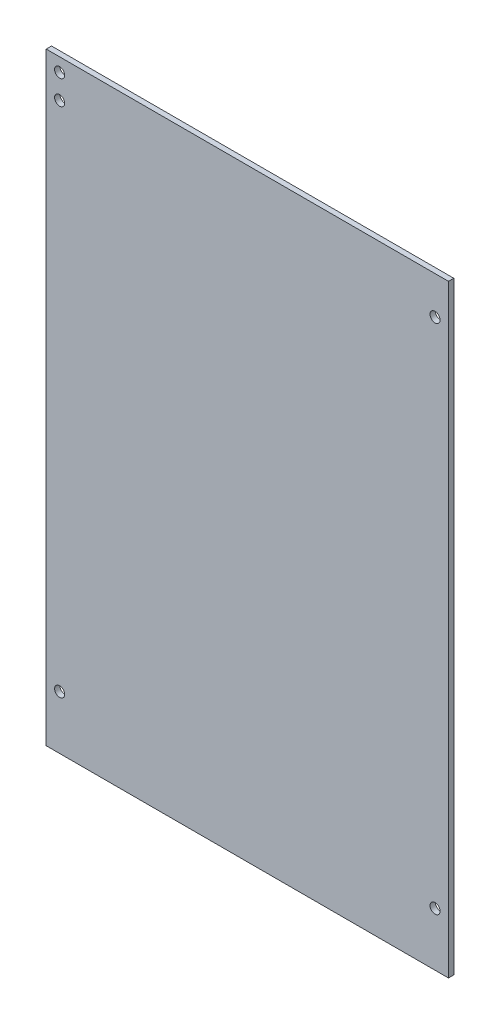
ISO-10303-21;
HEADER;
FILE_DESCRIPTION(('STEP AP214'),'2;1');
FILE_NAME('part.step','',(''),(''),'','','');
FILE_SCHEMA(('AUTOMOTIVE_DESIGN { 1 0 10303 214 1 1 1 1 }'));
ENDSEC;
DATA;
#1=APPLICATION_CONTEXT('core data for automotive mechanical design processes');
#2=APPLICATION_PROTOCOL_DEFINITION('international standard','automotive_design',2000,#1);
#3=PRODUCT_CONTEXT('',#1,'mechanical');
#4=PRODUCT('Part','Part','',(#3));
#5=PRODUCT_RELATED_PRODUCT_CATEGORY('part','',(#4));
#6=PRODUCT_DEFINITION_FORMATION('','',#4);
#7=PRODUCT_DEFINITION_CONTEXT('part definition',#1,'design');
#8=PRODUCT_DEFINITION('design','',#6,#7);
#9=PRODUCT_DEFINITION_SHAPE('','',#8);
#10=(LENGTH_UNIT() NAMED_UNIT(*) SI_UNIT(.MILLI.,.METRE.));
#11=(NAMED_UNIT(*) PLANE_ANGLE_UNIT() SI_UNIT($,.RADIAN.));
#12=(NAMED_UNIT(*) SI_UNIT($,.STERADIAN.) SOLID_ANGLE_UNIT());
#13=UNCERTAINTY_MEASURE_WITH_UNIT(LENGTH_MEASURE(1.E-05),#10,'distance_accuracy_value','');
#14=(GEOMETRIC_REPRESENTATION_CONTEXT(3) GLOBAL_UNCERTAINTY_ASSIGNED_CONTEXT((#13)) GLOBAL_UNIT_ASSIGNED_CONTEXT((#10,
#11,#12)) REPRESENTATION_CONTEXT('',''));
#15=CARTESIAN_POINT('',(0.,0.,0.));
#16=DIRECTION('',(0.,0.,1.));
#17=DIRECTION('',(1.,0.,0.));
#18=AXIS2_PLACEMENT_3D('',#15,#16,#17);
#19=CARTESIAN_POINT('',(-60.,90.,0.79375));
#20=DIRECTION('',(-1.,0.,0.));
#21=DIRECTION('',(0.,-1.,0.));
#22=AXIS2_PLACEMENT_3D('',#19,#20,#21);
#23=PLANE('',#22);
#24=DIRECTION('',(0.,1.,0.));
#25=VECTOR('',#24,1.);
#26=CARTESIAN_POINT('',(-60.,90.,-0.79375));
#27=LINE('',#26,#25);
#28=CARTESIAN_POINT('',(-60.,-90.,-0.79375));
#29=VERTEX_POINT('',#28);
#30=CARTESIAN_POINT('',(-60.,90.,-0.79375));
#31=VERTEX_POINT('',#30);
#32=EDGE_CURVE('E96',#29,#31,#27,.T.);
#33=ORIENTED_EDGE('',*,*,#32,.F.);
#34=DIRECTION('',(0.,0.,-1.));
#35=VECTOR('',#34,1.);
#36=CARTESIAN_POINT('',(-60.,-90.,0.79375));
#37=LINE('',#36,#35);
#38=CARTESIAN_POINT('',(-60.,-90.,0.79375));
#39=VERTEX_POINT('',#38);
#40=EDGE_CURVE('E11',#39,#29,#37,.T.);
#41=ORIENTED_EDGE('',*,*,#40,.F.);
#42=DIRECTION('',(0.,1.,0.));
#43=VECTOR('',#42,1.);
#44=CARTESIAN_POINT('',(-60.,90.,0.79375));
#45=LINE('',#44,#43);
#46=CARTESIAN_POINT('',(-60.,90.,0.79375));
#47=VERTEX_POINT('',#46);
#48=EDGE_CURVE('E89',#39,#47,#45,.T.);
#49=ORIENTED_EDGE('',*,*,#48,.T.);
#50=DIRECTION('',(0.,0.,-1.));
#51=VECTOR('',#50,1.);
#52=CARTESIAN_POINT('',(-60.,90.,0.79375));
#53=LINE('',#52,#51);
#54=EDGE_CURVE('E34',#47,#31,#53,.T.);
#55=ORIENTED_EDGE('',*,*,#54,.T.);
#56=EDGE_LOOP('',(#33,#41,#49,#55));
#57=FACE_BOUND('',#56,.T.);
#58=ADVANCED_FACE('F31',(#57),#23,.T.);
#59=CARTESIAN_POINT('',(-60.,-90.,0.79375));
#60=DIRECTION('',(0.,-1.,0.));
#61=DIRECTION('',(1.,0.,0.));
#62=AXIS2_PLACEMENT_3D('',#59,#60,#61);
#63=PLANE('',#62);
#64=DIRECTION('',(-1.,0.,0.));
#65=VECTOR('',#64,1.);
#66=CARTESIAN_POINT('',(-60.,-90.,-0.79375));
#67=LINE('',#66,#65);
#68=CARTESIAN_POINT('',(60.,-90.,-0.79375));
#69=VERTEX_POINT('',#68);
#70=EDGE_CURVE('E91',#69,#29,#67,.T.);
#71=ORIENTED_EDGE('',*,*,#70,.F.);
#72=DIRECTION('',(0.,0.,-1.));
#73=VECTOR('',#72,1.);
#74=CARTESIAN_POINT('',(60.,-90.,0.79375));
#75=LINE('',#74,#73);
#76=CARTESIAN_POINT('',(60.,-90.,0.79375));
#77=VERTEX_POINT('',#76);
#78=EDGE_CURVE('E40',#77,#69,#75,.T.);
#79=ORIENTED_EDGE('',*,*,#78,.F.);
#80=DIRECTION('',(-1.,0.,0.));
#81=VECTOR('',#80,1.);
#82=CARTESIAN_POINT('',(-60.,-90.,0.79375));
#83=LINE('',#82,#81);
#84=EDGE_CURVE('E86',#77,#39,#83,.T.);
#85=ORIENTED_EDGE('',*,*,#84,.T.);
#86=ORIENTED_EDGE('',*,*,#40,.T.);
#87=EDGE_LOOP('',(#71,#79,#85,#86));
#88=FACE_BOUND('',#87,.T.);
#89=ADVANCED_FACE('F107',(#88),#63,.T.);
#90=CARTESIAN_POINT('',(60.,90.,0.79375));
#91=DIRECTION('',(1.,0.,0.));
#92=DIRECTION('',(0.,1.,0.));
#93=AXIS2_PLACEMENT_3D('',#90,#91,#92);
#94=PLANE('',#93);
#95=DIRECTION('',(0.,-1.,0.));
#96=VECTOR('',#95,1.);
#97=CARTESIAN_POINT('',(60.,90.,-0.79375));
#98=LINE('',#97,#96);
#99=CARTESIAN_POINT('',(60.,90.,-0.79375));
#100=VERTEX_POINT('',#99);
#101=EDGE_CURVE('E81',#100,#69,#98,.T.);
#102=ORIENTED_EDGE('',*,*,#101,.F.);
#103=DIRECTION('',(0.,0.,-1.));
#104=VECTOR('',#103,1.);
#105=CARTESIAN_POINT('',(60.,90.,0.79375));
#106=LINE('',#105,#104);
#107=CARTESIAN_POINT('',(60.,90.,0.79375));
#108=VERTEX_POINT('',#107);
#109=EDGE_CURVE('E76',#108,#100,#106,.T.);
#110=ORIENTED_EDGE('',*,*,#109,.F.);
#111=DIRECTION('',(0.,-1.,0.));
#112=VECTOR('',#111,1.);
#113=CARTESIAN_POINT('',(60.,90.,0.79375));
#114=LINE('',#113,#112);
#115=EDGE_CURVE('E79',#108,#77,#114,.T.);
#116=ORIENTED_EDGE('',*,*,#115,.T.);
#117=ORIENTED_EDGE('',*,*,#78,.T.);
#118=EDGE_LOOP('',(#102,#110,#116,#117));
#119=FACE_BOUND('',#118,.T.);
#120=ADVANCED_FACE('F78',(#119),#94,.T.);
#121=CARTESIAN_POINT('',(-60.,90.,0.79375));
#122=DIRECTION('',(0.,1.,0.));
#123=DIRECTION('',(-1.,0.,0.));
#124=AXIS2_PLACEMENT_3D('',#121,#122,#123);
#125=PLANE('',#124);
#126=DIRECTION('',(1.,0.,0.));
#127=VECTOR('',#126,1.);
#128=CARTESIAN_POINT('',(-60.,90.,-0.79375));
#129=LINE('',#128,#127);
#130=EDGE_CURVE('E99',#31,#100,#129,.T.);
#131=ORIENTED_EDGE('',*,*,#130,.F.);
#132=ORIENTED_EDGE('',*,*,#54,.F.);
#133=DIRECTION('',(1.,0.,0.));
#134=VECTOR('',#133,1.);
#135=CARTESIAN_POINT('',(-60.,90.,0.79375));
#136=LINE('',#135,#134);
#137=EDGE_CURVE('E85',#47,#108,#136,.T.);
#138=ORIENTED_EDGE('',*,*,#137,.T.);
#139=ORIENTED_EDGE('',*,*,#109,.T.);
#140=EDGE_LOOP('',(#131,#132,#138,#139));
#141=FACE_BOUND('',#140,.T.);
#142=ADVANCED_FACE('F88',(#141),#125,.T.);
#143=CARTESIAN_POINT('',(-60.,-90.,0.79375));
#144=DIRECTION('',(0.,0.,1.));
#145=DIRECTION('',(1.,0.,0.));
#146=AXIS2_PLACEMENT_3D('',#143,#144,#145);
#147=PLANE('',#146);
#148=CARTESIAN_POINT('',(-56.,85.98,0.79375));
#149=DIRECTION('',(0.,0.,1.));
#150=DIRECTION('',(1.,0.,0.));
#151=AXIS2_PLACEMENT_3D('',#148,#149,#150);
#152=CIRCLE('',#151,1.5);
#153=CARTESIAN_POINT('',(-54.5,85.98,0.79375));
#154=VERTEX_POINT('',#153);
#155=EDGE_CURVE('E155',#154,#154,#152,.T.);
#156=ORIENTED_EDGE('',*,*,#155,.F.);
#157=EDGE_LOOP('',(#156));
#158=FACE_BOUND('',#157,.T.);
#159=CARTESIAN_POINT('',(-56.,78.74,0.79375));
#160=DIRECTION('',(0.,0.,1.));
#161=DIRECTION('',(-1.,0.,0.));
#162=AXIS2_PLACEMENT_3D('',#159,#160,#161);
#163=CIRCLE('',#162,1.5);
#164=CARTESIAN_POINT('',(-57.5,78.74,0.79375));
#165=VERTEX_POINT('',#164);
#166=EDGE_CURVE('E157',#165,#165,#163,.T.);
#167=ORIENTED_EDGE('',*,*,#166,.F.);
#168=EDGE_LOOP('',(#167));
#169=FACE_BOUND('',#168,.T.);
#170=CARTESIAN_POINT('',(56.,78.74,0.79375));
#171=DIRECTION('',(0.,0.,1.));
#172=DIRECTION('',(1.,0.,0.));
#173=AXIS2_PLACEMENT_3D('',#170,#171,#172);
#174=CIRCLE('',#173,1.5);
#175=CARTESIAN_POINT('',(57.5,78.74,0.79375));
#176=VERTEX_POINT('',#175);
#177=EDGE_CURVE('E163',#176,#176,#174,.T.);
#178=ORIENTED_EDGE('',*,*,#177,.F.);
#179=EDGE_LOOP('',(#178));
#180=FACE_BOUND('',#179,.T.);
#181=CARTESIAN_POINT('',(56.,-74.,0.79375));
#182=DIRECTION('',(0.,0.,1.));
#183=DIRECTION('',(-1.,0.,0.));
#184=AXIS2_PLACEMENT_3D('',#181,#182,#183);
#185=CIRCLE('',#184,1.5);
#186=CARTESIAN_POINT('',(54.5,-74.,0.79375));
#187=VERTEX_POINT('',#186);
#188=EDGE_CURVE('E169',#187,#187,#185,.T.);
#189=ORIENTED_EDGE('',*,*,#188,.F.);
#190=EDGE_LOOP('',(#189));
#191=FACE_BOUND('',#190,.T.);
#192=CARTESIAN_POINT('',(-56.,-74.,0.79375));
#193=DIRECTION('',(0.,0.,1.));
#194=DIRECTION('',(1.,0.,0.));
#195=AXIS2_PLACEMENT_3D('',#192,#193,#194);
#196=CIRCLE('',#195,1.5);
#197=CARTESIAN_POINT('',(-54.5,-74.,0.79375));
#198=VERTEX_POINT('',#197);
#199=EDGE_CURVE('E175',#198,#198,#196,.T.);
#200=ORIENTED_EDGE('',*,*,#199,.F.);
#201=EDGE_LOOP('',(#200));
#202=FACE_BOUND('',#201,.T.);
#203=ORIENTED_EDGE('',*,*,#48,.F.);
#204=ORIENTED_EDGE('',*,*,#84,.F.);
#205=ORIENTED_EDGE('',*,*,#115,.F.);
#206=ORIENTED_EDGE('',*,*,#137,.F.);
#207=EDGE_LOOP('',(#203,#204,#205,#206));
#208=FACE_BOUND('',#207,.T.);
#209=ADVANCED_FACE('F84',(#158,#169,#180,#191,#202,#208),#147,.T.);
#210=CARTESIAN_POINT('',(-60.,-90.,-0.79375));
#211=DIRECTION('',(0.,0.,1.));
#212=DIRECTION('',(1.,0.,0.));
#213=AXIS2_PLACEMENT_3D('',#210,#211,#212);
#214=PLANE('',#213);
#215=CARTESIAN_POINT('',(-56.,85.98,-0.79375));
#216=DIRECTION('',(0.,0.,1.));
#217=DIRECTION('',(1.,0.,0.));
#218=AXIS2_PLACEMENT_3D('',#215,#216,#217);
#219=CIRCLE('',#218,1.5);
#220=CARTESIAN_POINT('',(-54.5,85.98,-0.79375));
#221=VERTEX_POINT('',#220);
#222=EDGE_CURVE('E153',#221,#221,#219,.T.);
#223=ORIENTED_EDGE('',*,*,#222,.T.);
#224=EDGE_LOOP('',(#223));
#225=FACE_BOUND('',#224,.T.);
#226=CARTESIAN_POINT('',(-56.,78.74,-0.79375));
#227=DIRECTION('',(0.,0.,1.));
#228=DIRECTION('',(-1.,0.,0.));
#229=AXIS2_PLACEMENT_3D('',#226,#227,#228);
#230=CIRCLE('',#229,1.5);
#231=CARTESIAN_POINT('',(-57.5,78.74,-0.79375));
#232=VERTEX_POINT('',#231);
#233=EDGE_CURVE('E160',#232,#232,#230,.T.);
#234=ORIENTED_EDGE('',*,*,#233,.T.);
#235=EDGE_LOOP('',(#234));
#236=FACE_BOUND('',#235,.T.);
#237=CARTESIAN_POINT('',(56.,78.74,-0.79375));
#238=DIRECTION('',(0.,0.,1.));
#239=DIRECTION('',(1.,0.,0.));
#240=AXIS2_PLACEMENT_3D('',#237,#238,#239);
#241=CIRCLE('',#240,1.5);
#242=CARTESIAN_POINT('',(57.5,78.74,-0.79375));
#243=VERTEX_POINT('',#242);
#244=EDGE_CURVE('E166',#243,#243,#241,.T.);
#245=ORIENTED_EDGE('',*,*,#244,.T.);
#246=EDGE_LOOP('',(#245));
#247=FACE_BOUND('',#246,.T.);
#248=CARTESIAN_POINT('',(56.,-74.,-0.79375));
#249=DIRECTION('',(0.,0.,1.));
#250=DIRECTION('',(-1.,0.,0.));
#251=AXIS2_PLACEMENT_3D('',#248,#249,#250);
#252=CIRCLE('',#251,1.5);
#253=CARTESIAN_POINT('',(54.5,-74.,-0.79375));
#254=VERTEX_POINT('',#253);
#255=EDGE_CURVE('E172',#254,#254,#252,.T.);
#256=ORIENTED_EDGE('',*,*,#255,.T.);
#257=EDGE_LOOP('',(#256));
#258=FACE_BOUND('',#257,.T.);
#259=CARTESIAN_POINT('',(-56.,-74.,-0.79375));
#260=DIRECTION('',(0.,0.,1.));
#261=DIRECTION('',(1.,0.,0.));
#262=AXIS2_PLACEMENT_3D('',#259,#260,#261);
#263=CIRCLE('',#262,1.5);
#264=CARTESIAN_POINT('',(-54.5,-74.,-0.79375));
#265=VERTEX_POINT('',#264);
#266=EDGE_CURVE('E100',#265,#265,#263,.T.);
#267=ORIENTED_EDGE('',*,*,#266,.T.);
#268=EDGE_LOOP('',(#267));
#269=FACE_BOUND('',#268,.T.);
#270=ORIENTED_EDGE('',*,*,#32,.T.);
#271=ORIENTED_EDGE('',*,*,#130,.T.);
#272=ORIENTED_EDGE('',*,*,#101,.T.);
#273=ORIENTED_EDGE('',*,*,#70,.T.);
#274=EDGE_LOOP('',(#270,#271,#272,#273));
#275=FACE_BOUND('',#274,.T.);
#276=ADVANCED_FACE('F106',(#225,#236,#247,#258,#269,#275),#214,.F.);
#277=CARTESIAN_POINT('',(-56.,-74.,-0.79375));
#278=DIRECTION('',(0.,0.,1.));
#279=DIRECTION('',(1.,0.,0.));
#280=AXIS2_PLACEMENT_3D('',#277,#278,#279);
#281=CYLINDRICAL_SURFACE('',#280,1.5);
#282=ORIENTED_EDGE('',*,*,#266,.F.);
#283=EDGE_LOOP('',(#282));
#284=FACE_BOUND('',#283,.T.);
#285=ORIENTED_EDGE('',*,*,#199,.T.);
#286=EDGE_LOOP('',(#285));
#287=FACE_BOUND('',#286,.T.);
#288=ADVANCED_FACE('F125',(#284,#287),#281,.F.);
#289=CARTESIAN_POINT('',(56.,-74.,-0.79375));
#290=DIRECTION('',(0.,0.,1.));
#291=DIRECTION('',(1.,0.,0.));
#292=AXIS2_PLACEMENT_3D('',#289,#290,#291);
#293=CYLINDRICAL_SURFACE('',#292,1.5);
#294=ORIENTED_EDGE('',*,*,#255,.F.);
#295=EDGE_LOOP('',(#294));
#296=FACE_BOUND('',#295,.T.);
#297=ORIENTED_EDGE('',*,*,#188,.T.);
#298=EDGE_LOOP('',(#297));
#299=FACE_BOUND('',#298,.T.);
#300=ADVANCED_FACE('F132',(#296,#299),#293,.F.);
#301=CARTESIAN_POINT('',(56.,78.74,-0.79375));
#302=DIRECTION('',(0.,0.,1.));
#303=DIRECTION('',(1.,0.,0.));
#304=AXIS2_PLACEMENT_3D('',#301,#302,#303);
#305=CYLINDRICAL_SURFACE('',#304,1.5);
#306=ORIENTED_EDGE('',*,*,#244,.F.);
#307=EDGE_LOOP('',(#306));
#308=FACE_BOUND('',#307,.T.);
#309=ORIENTED_EDGE('',*,*,#177,.T.);
#310=EDGE_LOOP('',(#309));
#311=FACE_BOUND('',#310,.T.);
#312=ADVANCED_FACE('F136',(#308,#311),#305,.F.);
#313=CARTESIAN_POINT('',(-56.,78.74,-0.79375));
#314=DIRECTION('',(0.,0.,1.));
#315=DIRECTION('',(1.,0.,0.));
#316=AXIS2_PLACEMENT_3D('',#313,#314,#315);
#317=CYLINDRICAL_SURFACE('',#316,1.5);
#318=ORIENTED_EDGE('',*,*,#233,.F.);
#319=EDGE_LOOP('',(#318));
#320=FACE_BOUND('',#319,.T.);
#321=ORIENTED_EDGE('',*,*,#166,.T.);
#322=EDGE_LOOP('',(#321));
#323=FACE_BOUND('',#322,.T.);
#324=ADVANCED_FACE('F140',(#320,#323),#317,.F.);
#325=CARTESIAN_POINT('',(-56.,85.98,-0.79375));
#326=DIRECTION('',(0.,0.,1.));
#327=DIRECTION('',(1.,0.,0.));
#328=AXIS2_PLACEMENT_3D('',#325,#326,#327);
#329=CYLINDRICAL_SURFACE('',#328,1.5);
#330=ORIENTED_EDGE('',*,*,#222,.F.);
#331=EDGE_LOOP('',(#330));
#332=FACE_BOUND('',#331,.T.);
#333=ORIENTED_EDGE('',*,*,#155,.T.);
#334=EDGE_LOOP('',(#333));
#335=FACE_BOUND('',#334,.T.);
#336=ADVANCED_FACE('F144',(#332,#335),#329,.F.);
#337=CLOSED_SHELL('',(#58,#89,#120,#142,#209,#276,#288,#300,#312,#324,#336));
#338=MANIFOLD_SOLID_BREP('B2',#337);
#339=ADVANCED_BREP_SHAPE_REPRESENTATION('',(#18,#338),#14);
#340=SHAPE_DEFINITION_REPRESENTATION(#9,#339);
ENDSEC;
END-ISO-10303-21;
